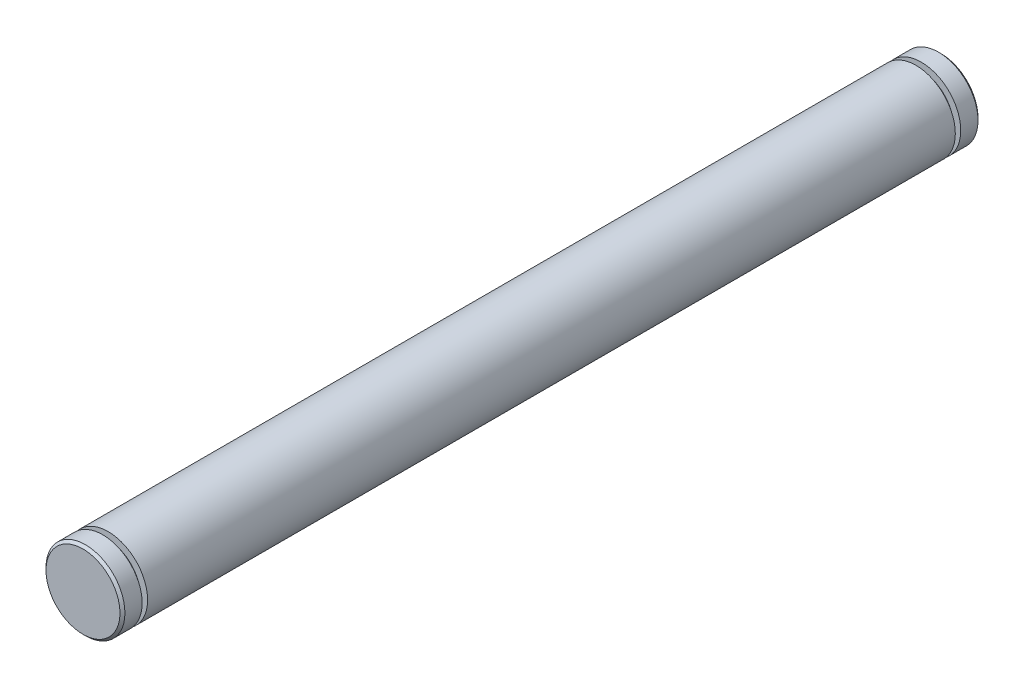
ISO-10303-21;
HEADER;
FILE_DESCRIPTION(('STEP AP214'),'2;1');
FILE_NAME('part.step','',(''),(''),'','','');
FILE_SCHEMA(('AUTOMOTIVE_DESIGN { 1 0 10303 214 1 1 1 1 }'));
ENDSEC;
DATA;
#1=APPLICATION_CONTEXT('core data for automotive mechanical design processes');
#2=APPLICATION_PROTOCOL_DEFINITION('international standard','automotive_design',2000,#1);
#3=PRODUCT_CONTEXT('',#1,'mechanical');
#4=PRODUCT('Part','Part','',(#3));
#5=PRODUCT_RELATED_PRODUCT_CATEGORY('part','',(#4));
#6=PRODUCT_DEFINITION_FORMATION('','',#4);
#7=PRODUCT_DEFINITION_CONTEXT('part definition',#1,'design');
#8=PRODUCT_DEFINITION('design','',#6,#7);
#9=PRODUCT_DEFINITION_SHAPE('','',#8);
#10=(LENGTH_UNIT() NAMED_UNIT(*) SI_UNIT(.MILLI.,.METRE.));
#11=(NAMED_UNIT(*) PLANE_ANGLE_UNIT() SI_UNIT($,.RADIAN.));
#12=(NAMED_UNIT(*) SI_UNIT($,.STERADIAN.) SOLID_ANGLE_UNIT());
#13=UNCERTAINTY_MEASURE_WITH_UNIT(LENGTH_MEASURE(1.E-05),#10,'distance_accuracy_value','');
#14=(GEOMETRIC_REPRESENTATION_CONTEXT(3) GLOBAL_UNCERTAINTY_ASSIGNED_CONTEXT((#13)) GLOBAL_UNIT_ASSIGNED_CONTEXT((#10,
#11,#12)) REPRESENTATION_CONTEXT('',''));
#15=CARTESIAN_POINT('',(0.,0.,0.));
#16=DIRECTION('',(0.,0.,1.));
#17=DIRECTION('',(1.,0.,0.));
#18=AXIS2_PLACEMENT_3D('',#15,#16,#17);
#19=CARTESIAN_POINT('',(7.5,-7.5,-87.));
#20=DIRECTION('',(0.,0.,-1.));
#21=DIRECTION('',(-1.,0.,0.));
#22=AXIS2_PLACEMENT_3D('',#19,#20,#21);
#23=PLANE('',#22);
#24=CARTESIAN_POINT('',(0.,0.,-87.));
#25=DIRECTION('',(0.,0.,1.));
#26=DIRECTION('',(1.,0.,0.));
#27=AXIS2_PLACEMENT_3D('',#24,#25,#26);
#28=CIRCLE('',#27,7.5);
#29=CARTESIAN_POINT('',(7.5,0.,-87.));
#30=VERTEX_POINT('',#29);
#31=EDGE_CURVE('E73',#30,#30,#28,.F.);
#32=ORIENTED_EDGE('',*,*,#31,.T.);
#33=EDGE_LOOP('',(#32));
#34=FACE_BOUND('',#33,.T.);
#35=ADVANCED_FACE('F14',(#34),#23,.T.);
#36=CARTESIAN_POINT('',(0.,0.,-87.));
#37=DIRECTION('',(0.,0.,1.));
#38=DIRECTION('',(1.,0.,0.));
#39=AXIS2_PLACEMENT_3D('',#36,#37,#38);
#40=CONICAL_SURFACE('',#39,7.5,0.785398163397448);
#41=ORIENTED_EDGE('',*,*,#31,.F.);
#42=EDGE_LOOP('',(#41));
#43=FACE_BOUND('',#42,.T.);
#44=CARTESIAN_POINT('',(0.,0.,-86.5));
#45=DIRECTION('',(0.,0.,1.));
#46=DIRECTION('',(1.,0.,0.));
#47=AXIS2_PLACEMENT_3D('',#44,#45,#46);
#48=CIRCLE('',#47,8.);
#49=CARTESIAN_POINT('',(8.,0.,-86.5));
#50=VERTEX_POINT('',#49);
#51=EDGE_CURVE('E71',#50,#50,#48,.F.);
#52=ORIENTED_EDGE('',*,*,#51,.T.);
#53=EDGE_LOOP('',(#52));
#54=FACE_BOUND('',#53,.T.);
#55=ADVANCED_FACE('F83',(#43,#54),#40,.T.);
#56=CARTESIAN_POINT('',(0.,0.,-86.5));
#57=DIRECTION('',(0.,0.,1.));
#58=DIRECTION('',(1.,0.,0.));
#59=AXIS2_PLACEMENT_3D('',#56,#57,#58);
#60=CYLINDRICAL_SURFACE('',#59,8.);
#61=ORIENTED_EDGE('',*,*,#51,.F.);
#62=EDGE_LOOP('',(#61));
#63=FACE_BOUND('',#62,.T.);
#64=CARTESIAN_POINT('',(0.,0.,-83.0000000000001));
#65=DIRECTION('',(0.,0.,1.));
#66=DIRECTION('',(1.,0.,0.));
#67=AXIS2_PLACEMENT_3D('',#64,#65,#66);
#68=CIRCLE('',#67,8.);
#69=CARTESIAN_POINT('',(8.,0.,-83.0000000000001));
#70=VERTEX_POINT('',#69);
#71=EDGE_CURVE('E66',#70,#70,#68,.F.);
#72=ORIENTED_EDGE('',*,*,#71,.T.);
#73=EDGE_LOOP('',(#72));
#74=FACE_BOUND('',#73,.T.);
#75=ADVANCED_FACE('F85',(#63,#74),#60,.T.);
#76=CARTESIAN_POINT('',(-15.6084521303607,-2.47213595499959,-83.));
#77=DIRECTION('',(0.,0.,-1.));
#78=DIRECTION('',(0.587785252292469,0.809016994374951,0.));
#79=AXIS2_PLACEMENT_3D('',#76,#77,#78);
#80=PLANE('',#79);
#81=CARTESIAN_POINT('',(0.,0.,-83.));
#82=DIRECTION('',(0.,0.,1.));
#83=DIRECTION('',(1.,0.,0.));
#84=AXIS2_PLACEMENT_3D('',#81,#82,#83);
#85=CIRCLE('',#84,6.55);
#86=CARTESIAN_POINT('',(6.55,0.,-83.));
#87=VERTEX_POINT('',#86);
#88=EDGE_CURVE('E61',#87,#87,#85,.F.);
#89=ORIENTED_EDGE('',*,*,#88,.T.);
#90=EDGE_LOOP('',(#89));
#91=FACE_BOUND('',#90,.T.);
#92=ORIENTED_EDGE('',*,*,#71,.F.);
#93=EDGE_LOOP('',(#92));
#94=FACE_BOUND('',#93,.T.);
#95=ADVANCED_FACE('F88',(#91,#94),#80,.F.);
#96=CARTESIAN_POINT('',(0.,0.,-83.));
#97=DIRECTION('',(0.,0.,1.));
#98=DIRECTION('',(1.,0.,0.));
#99=AXIS2_PLACEMENT_3D('',#96,#97,#98);
#100=CYLINDRICAL_SURFACE('',#99,6.55);
#101=ORIENTED_EDGE('',*,*,#88,.F.);
#102=EDGE_LOOP('',(#101));
#103=FACE_BOUND('',#102,.T.);
#104=CARTESIAN_POINT('',(0.,0.,-81.9));
#105=DIRECTION('',(0.,0.,1.));
#106=DIRECTION('',(1.,0.,0.));
#107=AXIS2_PLACEMENT_3D('',#104,#105,#106);
#108=CIRCLE('',#107,6.55);
#109=CARTESIAN_POINT('',(6.55,0.,-81.9));
#110=VERTEX_POINT('',#109);
#111=EDGE_CURVE('E56',#110,#110,#108,.F.);
#112=ORIENTED_EDGE('',*,*,#111,.T.);
#113=EDGE_LOOP('',(#112));
#114=FACE_BOUND('',#113,.T.);
#115=ADVANCED_FACE('F93',(#103,#114),#100,.T.);
#116=CARTESIAN_POINT('',(2.47213595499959,-15.6084521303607,-81.9));
#117=DIRECTION('',(0.,0.,1.));
#118=DIRECTION('',(0.587785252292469,0.809016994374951,0.));
#119=AXIS2_PLACEMENT_3D('',#116,#117,#118);
#120=PLANE('',#119);
#121=ORIENTED_EDGE('',*,*,#111,.F.);
#122=EDGE_LOOP('',(#121));
#123=FACE_BOUND('',#122,.T.);
#124=CARTESIAN_POINT('',(0.,0.,-81.8999999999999));
#125=DIRECTION('',(0.,0.,1.));
#126=DIRECTION('',(1.,0.,0.));
#127=AXIS2_PLACEMENT_3D('',#124,#125,#126);
#128=CIRCLE('',#127,8.);
#129=CARTESIAN_POINT('',(8.,0.,-81.8999999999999));
#130=VERTEX_POINT('',#129);
#131=EDGE_CURVE('E51',#130,#130,#128,.F.);
#132=ORIENTED_EDGE('',*,*,#131,.T.);
#133=EDGE_LOOP('',(#132));
#134=FACE_BOUND('',#133,.T.);
#135=ADVANCED_FACE('F100',(#123,#134),#120,.F.);
#136=CARTESIAN_POINT('',(0.,0.,-81.8999999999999));
#137=DIRECTION('',(0.,0.,1.));
#138=DIRECTION('',(1.,0.,0.));
#139=AXIS2_PLACEMENT_3D('',#136,#137,#138);
#140=CYLINDRICAL_SURFACE('',#139,8.);
#141=ORIENTED_EDGE('',*,*,#131,.F.);
#142=EDGE_LOOP('',(#141));
#143=FACE_BOUND('',#142,.T.);
#144=CARTESIAN_POINT('',(0.,0.,81.9000000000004));
#145=DIRECTION('',(0.,0.,1.));
#146=DIRECTION('',(1.,0.,0.));
#147=AXIS2_PLACEMENT_3D('',#144,#145,#146);
#148=CIRCLE('',#147,8.);
#149=CARTESIAN_POINT('',(8.,0.,81.9000000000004));
#150=VERTEX_POINT('',#149);
#151=EDGE_CURVE('E46',#150,#150,#148,.F.);
#152=ORIENTED_EDGE('',*,*,#151,.T.);
#153=EDGE_LOOP('',(#152));
#154=FACE_BOUND('',#153,.T.);
#155=ADVANCED_FACE('F131',(#143,#154),#140,.T.);
#156=CARTESIAN_POINT('',(-15.6084521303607,-2.47213595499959,81.9));
#157=DIRECTION('',(0.,0.,-1.));
#158=DIRECTION('',(0.587785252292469,0.809016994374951,0.));
#159=AXIS2_PLACEMENT_3D('',#156,#157,#158);
#160=PLANE('',#159);
#161=CARTESIAN_POINT('',(0.,0.,81.9));
#162=DIRECTION('',(0.,0.,1.));
#163=DIRECTION('',(1.,0.,0.));
#164=AXIS2_PLACEMENT_3D('',#161,#162,#163);
#165=CIRCLE('',#164,6.55);
#166=CARTESIAN_POINT('',(6.55,0.,81.9));
#167=VERTEX_POINT('',#166);
#168=EDGE_CURVE('E41',#167,#167,#165,.F.);
#169=ORIENTED_EDGE('',*,*,#168,.T.);
#170=EDGE_LOOP('',(#169));
#171=FACE_BOUND('',#170,.T.);
#172=ORIENTED_EDGE('',*,*,#151,.F.);
#173=EDGE_LOOP('',(#172));
#174=FACE_BOUND('',#173,.T.);
#175=ADVANCED_FACE('F133',(#171,#174),#160,.F.);
#176=CARTESIAN_POINT('',(0.,0.,81.9));
#177=DIRECTION('',(0.,0.,1.));
#178=DIRECTION('',(1.,0.,0.));
#179=AXIS2_PLACEMENT_3D('',#176,#177,#178);
#180=CYLINDRICAL_SURFACE('',#179,6.55);
#181=ORIENTED_EDGE('',*,*,#168,.F.);
#182=EDGE_LOOP('',(#181));
#183=FACE_BOUND('',#182,.T.);
#184=CARTESIAN_POINT('',(0.,0.,83.));
#185=DIRECTION('',(0.,0.,1.));
#186=DIRECTION('',(1.,0.,0.));
#187=AXIS2_PLACEMENT_3D('',#184,#185,#186);
#188=CIRCLE('',#187,6.55);
#189=CARTESIAN_POINT('',(6.55,0.,83.));
#190=VERTEX_POINT('',#189);
#191=EDGE_CURVE('E36',#190,#190,#188,.F.);
#192=ORIENTED_EDGE('',*,*,#191,.T.);
#193=EDGE_LOOP('',(#192));
#194=FACE_BOUND('',#193,.T.);
#195=ADVANCED_FACE('F135',(#183,#194),#180,.T.);
#196=CARTESIAN_POINT('',(2.47213595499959,-15.6084521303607,83.));
#197=DIRECTION('',(0.,0.,1.));
#198=DIRECTION('',(0.587785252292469,0.809016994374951,0.));
#199=AXIS2_PLACEMENT_3D('',#196,#197,#198);
#200=PLANE('',#199);
#201=ORIENTED_EDGE('',*,*,#191,.F.);
#202=EDGE_LOOP('',(#201));
#203=FACE_BOUND('',#202,.T.);
#204=CARTESIAN_POINT('',(0.,0.,83.0000000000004));
#205=DIRECTION('',(0.,0.,1.));
#206=DIRECTION('',(0.,-1.,0.));
#207=AXIS2_PLACEMENT_3D('',#204,#205,#206);
#208=CIRCLE('',#207,8.);
#209=CARTESIAN_POINT('',(0.,-8.,83.0000000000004));
#210=VERTEX_POINT('',#209);
#211=EDGE_CURVE('E27',#210,#210,#208,.F.);
#212=ORIENTED_EDGE('',*,*,#211,.T.);
#213=EDGE_LOOP('',(#212));
#214=FACE_BOUND('',#213,.T.);
#215=ADVANCED_FACE('F116',(#203,#214),#200,.F.);
#216=CARTESIAN_POINT('',(0.,0.,83.0000000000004));
#217=DIRECTION('',(0.,0.,1.));
#218=DIRECTION('',(0.,-1.,0.));
#219=AXIS2_PLACEMENT_3D('',#216,#217,#218);
#220=CYLINDRICAL_SURFACE('',#219,8.);
#221=ORIENTED_EDGE('',*,*,#211,.F.);
#222=EDGE_LOOP('',(#221));
#223=FACE_BOUND('',#222,.T.);
#224=CARTESIAN_POINT('',(0.,0.,86.5));
#225=DIRECTION('',(0.,0.,1.));
#226=DIRECTION('',(1.,0.,0.));
#227=AXIS2_PLACEMENT_3D('',#224,#225,#226);
#228=CIRCLE('',#227,8.);
#229=CARTESIAN_POINT('',(8.,0.,86.5));
#230=VERTEX_POINT('',#229);
#231=EDGE_CURVE('E22',#230,#230,#228,.F.);
#232=ORIENTED_EDGE('',*,*,#231,.T.);
#233=EDGE_LOOP('',(#232));
#234=FACE_BOUND('',#233,.T.);
#235=ADVANCED_FACE('F110',(#223,#234),#220,.T.);
#236=CARTESIAN_POINT('',(0.,0.,86.5));
#237=DIRECTION('',(0.,0.,-1.));
#238=DIRECTION('',(-1.,0.,0.));
#239=AXIS2_PLACEMENT_3D('',#236,#237,#238);
#240=CONICAL_SURFACE('',#239,8.,0.785398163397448);
#241=ORIENTED_EDGE('',*,*,#231,.F.);
#242=EDGE_LOOP('',(#241));
#243=FACE_BOUND('',#242,.T.);
#244=CARTESIAN_POINT('',(0.,0.,87.));
#245=DIRECTION('',(0.,0.,-1.));
#246=DIRECTION('',(-1.,0.,0.));
#247=AXIS2_PLACEMENT_3D('',#244,#245,#246);
#248=CIRCLE('',#247,7.5);
#249=CARTESIAN_POINT('',(-7.5,0.,87.));
#250=VERTEX_POINT('',#249);
#251=EDGE_CURVE('E10',#250,#250,#248,.F.);
#252=ORIENTED_EDGE('',*,*,#251,.F.);
#253=EDGE_LOOP('',(#252));
#254=FACE_BOUND('',#253,.T.);
#255=ADVANCED_FACE('F106',(#243,#254),#240,.T.);
#256=CARTESIAN_POINT('',(-7.5,-7.5,87.));
#257=DIRECTION('',(0.,0.,1.));
#258=DIRECTION('',(1.,0.,0.));
#259=AXIS2_PLACEMENT_3D('',#256,#257,#258);
#260=PLANE('',#259);
#261=ORIENTED_EDGE('',*,*,#251,.T.);
#262=EDGE_LOOP('',(#261));
#263=FACE_BOUND('',#262,.T.);
#264=ADVANCED_FACE('F16',(#263),#260,.T.);
#265=CLOSED_SHELL('',(#35,#55,#75,#95,#115,#135,#155,#175,#195,#215,#235,#255,#264));
#266=MANIFOLD_SOLID_BREP('B1',#265);
#267=ADVANCED_BREP_SHAPE_REPRESENTATION('',(#18,#266),#14);
#268=SHAPE_DEFINITION_REPRESENTATION(#9,#267);
ENDSEC;
END-ISO-10303-21;
